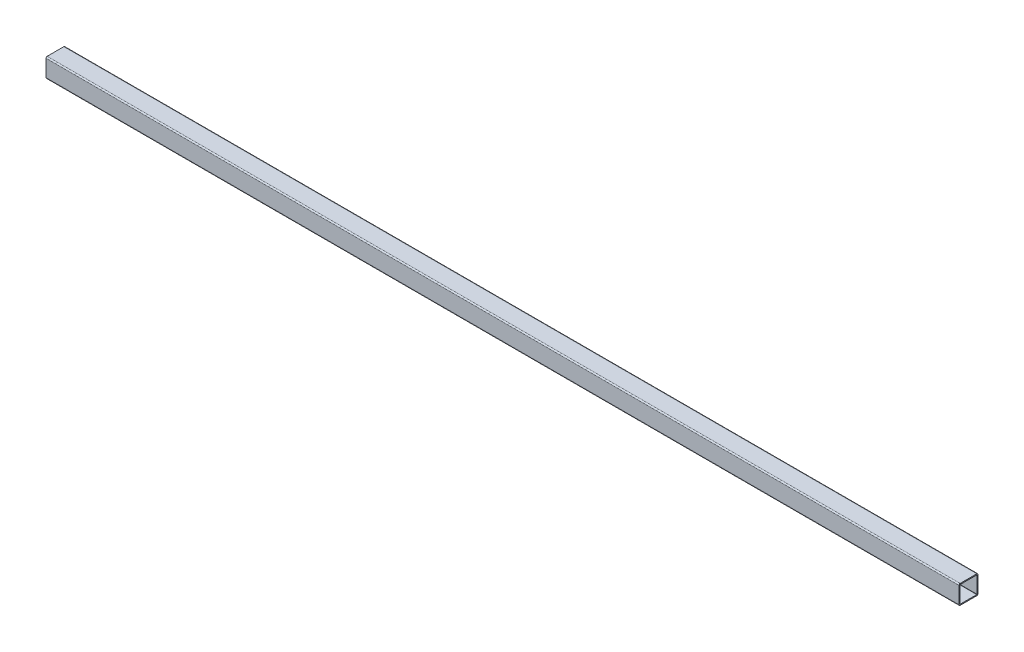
ISO-10303-21;
HEADER;
FILE_DESCRIPTION(('STEP AP214'),'2;1');
FILE_NAME('part.step','',(''),(''),'','','');
FILE_SCHEMA(('AUTOMOTIVE_DESIGN { 1 0 10303 214 1 1 1 1 }'));
ENDSEC;
DATA;
#1=APPLICATION_CONTEXT('core data for automotive mechanical design processes');
#2=APPLICATION_PROTOCOL_DEFINITION('international standard','automotive_design',2000,#1);
#3=PRODUCT_CONTEXT('',#1,'mechanical');
#4=PRODUCT('Part','Part','',(#3));
#5=PRODUCT_RELATED_PRODUCT_CATEGORY('part','',(#4));
#6=PRODUCT_DEFINITION_FORMATION('','',#4);
#7=PRODUCT_DEFINITION_CONTEXT('part definition',#1,'design');
#8=PRODUCT_DEFINITION('design','',#6,#7);
#9=PRODUCT_DEFINITION_SHAPE('','',#8);
#10=(LENGTH_UNIT() NAMED_UNIT(*) SI_UNIT(.MILLI.,.METRE.));
#11=(NAMED_UNIT(*) PLANE_ANGLE_UNIT() SI_UNIT($,.RADIAN.));
#12=(NAMED_UNIT(*) SI_UNIT($,.STERADIAN.) SOLID_ANGLE_UNIT());
#13=UNCERTAINTY_MEASURE_WITH_UNIT(LENGTH_MEASURE(1.E-05),#10,'distance_accuracy_value','');
#14=(GEOMETRIC_REPRESENTATION_CONTEXT(3) GLOBAL_UNCERTAINTY_ASSIGNED_CONTEXT((#13)) GLOBAL_UNIT_ASSIGNED_CONTEXT((#10,
#11,#12)) REPRESENTATION_CONTEXT('',''));
#15=CARTESIAN_POINT('',(0.,0.,0.));
#16=DIRECTION('',(0.,0.,1.));
#17=DIRECTION('',(1.,0.,0.));
#18=AXIS2_PLACEMENT_3D('',#15,#16,#17);
#19=CARTESIAN_POINT('',(1219.2,3.65674086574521,-16.8519621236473));
#20=DIRECTION('',(-1.,0.,0.));
#21=DIRECTION('',(0.,0.,1.));
#22=AXIS2_PLACEMENT_3D('',#19,#20,#21);
#23=PLANE('',#22);
#24=CARTESIAN_POINT('',(1219.2,3.65674086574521,-16.8519621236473));
#25=DIRECTION('',(1.,0.,0.));
#26=DIRECTION('',(0.,0.,1.));
#27=AXIS2_PLACEMENT_3D('',#24,#25,#26);
#28=CIRCLE('',#27,1.5875);
#29=CARTESIAN_POINT('',(1219.2,3.6567408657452,-18.4394621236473));
#30=VERTEX_POINT('',#29);
#31=CARTESIAN_POINT('',(1219.2,5.24424086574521,-16.8519621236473));
#32=VERTEX_POINT('',#31);
#33=EDGE_CURVE('E211',#30,#32,#28,.T.);
#34=ORIENTED_EDGE('',*,*,#33,.T.);
#35=DIRECTION('',(0.,0.,1.));
#36=VECTOR('',#35,1.);
#37=CARTESIAN_POINT('',(1219.2,5.24424086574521,5.37303787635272));
#38=LINE('',#37,#36);
#39=CARTESIAN_POINT('',(1219.2,5.24424086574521,5.37303787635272));
#40=VERTEX_POINT('',#39);
#41=EDGE_CURVE('E214',#32,#40,#38,.T.);
#42=ORIENTED_EDGE('',*,*,#41,.T.);
#43=CARTESIAN_POINT('',(1219.2,3.65674086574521,5.37303787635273));
#44=DIRECTION('',(1.,0.,0.));
#45=DIRECTION('',(0.,0.,1.));
#46=AXIS2_PLACEMENT_3D('',#43,#44,#45);
#47=CIRCLE('',#46,1.5875);
#48=CARTESIAN_POINT('',(1219.2,3.6567408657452,6.96053787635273));
#49=VERTEX_POINT('',#48);
#50=EDGE_CURVE('E217',#40,#49,#47,.T.);
#51=ORIENTED_EDGE('',*,*,#50,.T.);
#52=DIRECTION('',(0.,-1.,0.));
#53=VECTOR('',#52,1.);
#54=CARTESIAN_POINT('',(1219.2,3.6567408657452,6.96053787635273));
#55=LINE('',#54,#53);
#56=CARTESIAN_POINT('',(1219.2,-18.5682591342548,6.96053787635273));
#57=VERTEX_POINT('',#56);
#58=EDGE_CURVE('E219',#49,#57,#55,.T.);
#59=ORIENTED_EDGE('',*,*,#58,.T.);
#60=CARTESIAN_POINT('',(1219.2,-18.5682591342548,5.37303787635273));
#61=DIRECTION('',(1.,0.,0.));
#62=DIRECTION('',(0.,0.,1.));
#63=AXIS2_PLACEMENT_3D('',#60,#61,#62);
#64=CIRCLE('',#63,1.5875);
#65=CARTESIAN_POINT('',(1219.2,-20.1557591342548,5.37303787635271));
#66=VERTEX_POINT('',#65);
#67=EDGE_CURVE('E221',#57,#66,#64,.T.);
#68=ORIENTED_EDGE('',*,*,#67,.T.);
#69=DIRECTION('',(0.,0.,-1.));
#70=VECTOR('',#69,1.);
#71=CARTESIAN_POINT('',(1219.2,-20.1557591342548,5.37303787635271));
#72=LINE('',#71,#70);
#73=CARTESIAN_POINT('',(1219.2,-20.1557591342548,-16.8519621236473));
#74=VERTEX_POINT('',#73);
#75=EDGE_CURVE('E223',#66,#74,#72,.T.);
#76=ORIENTED_EDGE('',*,*,#75,.T.);
#77=CARTESIAN_POINT('',(1219.2,-18.5682591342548,-16.8519621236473));
#78=DIRECTION('',(1.,0.,0.));
#79=DIRECTION('',(0.,0.,1.));
#80=AXIS2_PLACEMENT_3D('',#77,#78,#79);
#81=CIRCLE('',#80,1.5875);
#82=CARTESIAN_POINT('',(1219.2,-18.5682591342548,-18.4394621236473));
#83=VERTEX_POINT('',#82);
#84=EDGE_CURVE('E225',#74,#83,#81,.T.);
#85=ORIENTED_EDGE('',*,*,#84,.T.);
#86=DIRECTION('',(0.,1.,0.));
#87=VECTOR('',#86,1.);
#88=CARTESIAN_POINT('',(1219.2,3.6567408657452,-18.4394621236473));
#89=LINE('',#88,#87);
#90=EDGE_CURVE('E227',#83,#30,#89,.T.);
#91=ORIENTED_EDGE('',*,*,#90,.T.);
#92=EDGE_LOOP('',(#34,#42,#51,#59,#68,#76,#85,#91));
#93=FACE_BOUND('',#92,.T.);
#94=CARTESIAN_POINT('',(1219.2,3.65674086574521,5.37303787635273));
#95=DIRECTION('',(1.,0.,0.));
#96=DIRECTION('',(0.,0.,1.));
#97=AXIS2_PLACEMENT_3D('',#94,#95,#96);
#98=CIRCLE('',#97,0.2413);
#99=CARTESIAN_POINT('',(1219.2,3.89804086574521,5.37303787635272));
#100=VERTEX_POINT('',#99);
#101=CARTESIAN_POINT('',(1219.2,3.6567408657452,5.61433787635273));
#102=VERTEX_POINT('',#101);
#103=EDGE_CURVE('E146',#100,#102,#98,.T.);
#104=ORIENTED_EDGE('',*,*,#103,.F.);
#105=DIRECTION('',(0.,0.,1.));
#106=VECTOR('',#105,1.);
#107=CARTESIAN_POINT('',(1219.2,3.89804086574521,5.37303787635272));
#108=LINE('',#107,#106);
#109=CARTESIAN_POINT('',(1219.2,3.89804086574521,-16.8519621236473));
#110=VERTEX_POINT('',#109);
#111=EDGE_CURVE('E179',#110,#100,#108,.T.);
#112=ORIENTED_EDGE('',*,*,#111,.F.);
#113=CARTESIAN_POINT('',(1219.2,3.65674086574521,-16.8519621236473));
#114=DIRECTION('',(1.,0.,0.));
#115=DIRECTION('',(0.,0.,1.));
#116=AXIS2_PLACEMENT_3D('',#113,#114,#115);
#117=CIRCLE('',#116,0.2413);
#118=CARTESIAN_POINT('',(1219.2,3.65674086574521,-17.0932621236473));
#119=VERTEX_POINT('',#118);
#120=EDGE_CURVE('E177',#119,#110,#117,.T.);
#121=ORIENTED_EDGE('',*,*,#120,.F.);
#122=DIRECTION('',(0.,1.,0.));
#123=VECTOR('',#122,1.);
#124=CARTESIAN_POINT('',(1219.2,3.65674086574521,-17.0932621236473));
#125=LINE('',#124,#123);
#126=CARTESIAN_POINT('',(1219.2,-18.5682591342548,-17.0932621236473));
#127=VERTEX_POINT('',#126);
#128=EDGE_CURVE('E175',#127,#119,#125,.T.);
#129=ORIENTED_EDGE('',*,*,#128,.F.);
#130=CARTESIAN_POINT('',(1219.2,-18.5682591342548,-16.8519621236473));
#131=DIRECTION('',(1.,0.,0.));
#132=DIRECTION('',(0.,0.,1.));
#133=AXIS2_PLACEMENT_3D('',#130,#131,#132);
#134=CIRCLE('',#133,0.241299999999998);
#135=CARTESIAN_POINT('',(1219.2,-18.8095591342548,-16.8519621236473));
#136=VERTEX_POINT('',#135);
#137=EDGE_CURVE('E173',#136,#127,#134,.T.);
#138=ORIENTED_EDGE('',*,*,#137,.F.);
#139=DIRECTION('',(0.,0.,-1.));
#140=VECTOR('',#139,1.);
#141=CARTESIAN_POINT('',(1219.2,-18.8095591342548,5.37303787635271));
#142=LINE('',#141,#140);
#143=CARTESIAN_POINT('',(1219.2,-18.8095591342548,5.37303787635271));
#144=VERTEX_POINT('',#143);
#145=EDGE_CURVE('E169',#144,#136,#142,.T.);
#146=ORIENTED_EDGE('',*,*,#145,.F.);
#147=CARTESIAN_POINT('',(1219.2,-18.5682591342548,5.37303787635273));
#148=DIRECTION('',(1.,0.,0.));
#149=DIRECTION('',(0.,0.,1.));
#150=AXIS2_PLACEMENT_3D('',#147,#148,#149);
#151=CIRCLE('',#150,0.241299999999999);
#152=CARTESIAN_POINT('',(1219.2,-18.5682591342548,5.61433787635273));
#153=VERTEX_POINT('',#152);
#154=EDGE_CURVE('E167',#153,#144,#151,.T.);
#155=ORIENTED_EDGE('',*,*,#154,.F.);
#156=DIRECTION('',(0.,-1.,0.));
#157=VECTOR('',#156,1.);
#158=CARTESIAN_POINT('',(1219.2,3.6567408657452,5.61433787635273));
#159=LINE('',#158,#157);
#160=EDGE_CURVE('E154',#102,#153,#159,.T.);
#161=ORIENTED_EDGE('',*,*,#160,.F.);
#162=EDGE_LOOP('',(#104,#112,#121,#129,#138,#146,#155,#161));
#163=FACE_BOUND('',#162,.T.);
#164=ADVANCED_FACE('F33',(#93,#163),#23,.F.);
#165=CARTESIAN_POINT('',(0.,3.65674086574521,-16.8519621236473));
#166=DIRECTION('',(-1.,0.,0.));
#167=DIRECTION('',(0.,0.,1.));
#168=AXIS2_PLACEMENT_3D('',#165,#166,#167);
#169=PLANE('',#168);
#170=CARTESIAN_POINT('',(0.,3.65674086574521,-16.8519621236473));
#171=DIRECTION('',(1.,0.,0.));
#172=DIRECTION('',(0.,0.,1.));
#173=AXIS2_PLACEMENT_3D('',#170,#171,#172);
#174=CIRCLE('',#173,1.5875);
#175=CARTESIAN_POINT('',(0.,3.6567408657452,-18.4394621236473));
#176=VERTEX_POINT('',#175);
#177=CARTESIAN_POINT('',(0.,5.24424086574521,-16.8519621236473));
#178=VERTEX_POINT('',#177);
#179=EDGE_CURVE('E162',#176,#178,#174,.T.);
#180=ORIENTED_EDGE('',*,*,#179,.F.);
#181=DIRECTION('',(0.,1.,0.));
#182=VECTOR('',#181,1.);
#183=CARTESIAN_POINT('',(0.,3.6567408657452,-18.4394621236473));
#184=LINE('',#183,#182);
#185=CARTESIAN_POINT('',(0.,-18.5682591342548,-18.4394621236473));
#186=VERTEX_POINT('',#185);
#187=EDGE_CURVE('E215',#186,#176,#184,.T.);
#188=ORIENTED_EDGE('',*,*,#187,.F.);
#189=CARTESIAN_POINT('',(0.,-18.5682591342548,-16.8519621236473));
#190=DIRECTION('',(1.,0.,0.));
#191=DIRECTION('',(0.,0.,1.));
#192=AXIS2_PLACEMENT_3D('',#189,#190,#191);
#193=CIRCLE('',#192,1.5875);
#194=CARTESIAN_POINT('',(0.,-20.1557591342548,-16.8519621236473));
#195=VERTEX_POINT('',#194);
#196=EDGE_CURVE('E242',#195,#186,#193,.T.);
#197=ORIENTED_EDGE('',*,*,#196,.F.);
#198=DIRECTION('',(0.,0.,-1.));
#199=VECTOR('',#198,1.);
#200=CARTESIAN_POINT('',(0.,-20.1557591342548,5.37303787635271));
#201=LINE('',#200,#199);
#202=CARTESIAN_POINT('',(0.,-20.1557591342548,5.37303787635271));
#203=VERTEX_POINT('',#202);
#204=EDGE_CURVE('E240',#203,#195,#201,.T.);
#205=ORIENTED_EDGE('',*,*,#204,.F.);
#206=CARTESIAN_POINT('',(0.,-18.5682591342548,5.37303787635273));
#207=DIRECTION('',(1.,0.,0.));
#208=DIRECTION('',(0.,0.,1.));
#209=AXIS2_PLACEMENT_3D('',#206,#207,#208);
#210=CIRCLE('',#209,1.5875);
#211=CARTESIAN_POINT('',(0.,-18.5682591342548,6.96053787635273));
#212=VERTEX_POINT('',#211);
#213=EDGE_CURVE('E238',#212,#203,#210,.T.);
#214=ORIENTED_EDGE('',*,*,#213,.F.);
#215=DIRECTION('',(0.,-1.,0.));
#216=VECTOR('',#215,1.);
#217=CARTESIAN_POINT('',(0.,3.6567408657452,6.96053787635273));
#218=LINE('',#217,#216);
#219=CARTESIAN_POINT('',(0.,3.6567408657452,6.96053787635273));
#220=VERTEX_POINT('',#219);
#221=EDGE_CURVE('E236',#220,#212,#218,.T.);
#222=ORIENTED_EDGE('',*,*,#221,.F.);
#223=CARTESIAN_POINT('',(0.,3.65674086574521,5.37303787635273));
#224=DIRECTION('',(1.,0.,0.));
#225=DIRECTION('',(0.,0.,1.));
#226=AXIS2_PLACEMENT_3D('',#223,#224,#225);
#227=CIRCLE('',#226,1.5875);
#228=CARTESIAN_POINT('',(0.,5.24424086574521,5.37303787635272));
#229=VERTEX_POINT('',#228);
#230=EDGE_CURVE('E234',#229,#220,#227,.T.);
#231=ORIENTED_EDGE('',*,*,#230,.F.);
#232=DIRECTION('',(0.,0.,1.));
#233=VECTOR('',#232,1.);
#234=CARTESIAN_POINT('',(0.,5.24424086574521,5.37303787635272));
#235=LINE('',#234,#233);
#236=EDGE_CURVE('E232',#178,#229,#235,.T.);
#237=ORIENTED_EDGE('',*,*,#236,.F.);
#238=EDGE_LOOP('',(#180,#188,#197,#205,#214,#222,#231,#237));
#239=FACE_BOUND('',#238,.T.);
#240=DIRECTION('',(0.,0.,1.));
#241=VECTOR('',#240,1.);
#242=CARTESIAN_POINT('',(0.,3.89804086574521,5.37303787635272));
#243=LINE('',#242,#241);
#244=CARTESIAN_POINT('',(0.,3.89804086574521,-16.8519621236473));
#245=VERTEX_POINT('',#244);
#246=CARTESIAN_POINT('',(0.,3.89804086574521,5.37303787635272));
#247=VERTEX_POINT('',#246);
#248=EDGE_CURVE('E155',#245,#247,#243,.T.);
#249=ORIENTED_EDGE('',*,*,#248,.T.);
#250=CARTESIAN_POINT('',(0.,3.65674086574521,5.37303787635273));
#251=DIRECTION('',(1.,0.,0.));
#252=DIRECTION('',(0.,0.,1.));
#253=AXIS2_PLACEMENT_3D('',#250,#251,#252);
#254=CIRCLE('',#253,0.2413);
#255=CARTESIAN_POINT('',(0.,3.6567408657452,5.61433787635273));
#256=VERTEX_POINT('',#255);
#257=EDGE_CURVE('E56',#247,#256,#254,.T.);
#258=ORIENTED_EDGE('',*,*,#257,.T.);
#259=DIRECTION('',(0.,-1.,0.));
#260=VECTOR('',#259,1.);
#261=CARTESIAN_POINT('',(0.,3.6567408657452,5.61433787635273));
#262=LINE('',#261,#260);
#263=CARTESIAN_POINT('',(0.,-18.5682591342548,5.61433787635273));
#264=VERTEX_POINT('',#263);
#265=EDGE_CURVE('E161',#256,#264,#262,.T.);
#266=ORIENTED_EDGE('',*,*,#265,.T.);
#267=CARTESIAN_POINT('',(0.,-18.5682591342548,5.37303787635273));
#268=DIRECTION('',(1.,0.,0.));
#269=DIRECTION('',(0.,0.,1.));
#270=AXIS2_PLACEMENT_3D('',#267,#268,#269);
#271=CIRCLE('',#270,0.241299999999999);
#272=CARTESIAN_POINT('',(0.,-18.8095591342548,5.37303787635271));
#273=VERTEX_POINT('',#272);
#274=EDGE_CURVE('E183',#264,#273,#271,.T.);
#275=ORIENTED_EDGE('',*,*,#274,.T.);
#276=DIRECTION('',(0.,0.,-1.));
#277=VECTOR('',#276,1.);
#278=CARTESIAN_POINT('',(0.,-18.8095591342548,5.37303787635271));
#279=LINE('',#278,#277);
#280=CARTESIAN_POINT('',(0.,-18.8095591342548,-16.8519621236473));
#281=VERTEX_POINT('',#280);
#282=EDGE_CURVE('E186',#273,#281,#279,.T.);
#283=ORIENTED_EDGE('',*,*,#282,.T.);
#284=CARTESIAN_POINT('',(0.,-18.5682591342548,-16.8519621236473));
#285=DIRECTION('',(1.,0.,0.));
#286=DIRECTION('',(0.,0.,1.));
#287=AXIS2_PLACEMENT_3D('',#284,#285,#286);
#288=CIRCLE('',#287,0.241299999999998);
#289=CARTESIAN_POINT('',(0.,-18.5682591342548,-17.0932621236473));
#290=VERTEX_POINT('',#289);
#291=EDGE_CURVE('E189',#281,#290,#288,.T.);
#292=ORIENTED_EDGE('',*,*,#291,.T.);
#293=DIRECTION('',(0.,1.,0.));
#294=VECTOR('',#293,1.);
#295=CARTESIAN_POINT('',(0.,3.65674086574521,-17.0932621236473));
#296=LINE('',#295,#294);
#297=CARTESIAN_POINT('',(0.,3.65674086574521,-17.0932621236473));
#298=VERTEX_POINT('',#297);
#299=EDGE_CURVE('E192',#290,#298,#296,.T.);
#300=ORIENTED_EDGE('',*,*,#299,.T.);
#301=CARTESIAN_POINT('',(0.,3.65674086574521,-16.8519621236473));
#302=DIRECTION('',(1.,0.,0.));
#303=DIRECTION('',(0.,0.,1.));
#304=AXIS2_PLACEMENT_3D('',#301,#302,#303);
#305=CIRCLE('',#304,0.2413);
#306=EDGE_CURVE('E195',#298,#245,#305,.T.);
#307=ORIENTED_EDGE('',*,*,#306,.T.);
#308=EDGE_LOOP('',(#249,#258,#266,#275,#283,#292,#300,#307));
#309=FACE_BOUND('',#308,.T.);
#310=ADVANCED_FACE('F272',(#239,#309),#169,.T.);
#311=CARTESIAN_POINT('',(1219.2,3.65674086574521,-16.8519621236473));
#312=DIRECTION('',(-1.,0.,0.));
#313=DIRECTION('',(0.,0.,1.));
#314=AXIS2_PLACEMENT_3D('',#311,#312,#313);
#315=CYLINDRICAL_SURFACE('',#314,1.5875);
#316=ORIENTED_EDGE('',*,*,#179,.T.);
#317=DIRECTION('',(-1.,0.,0.));
#318=VECTOR('',#317,1.);
#319=CARTESIAN_POINT('',(1219.2,5.24424086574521,-16.8519621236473));
#320=LINE('',#319,#318);
#321=EDGE_CURVE('E11',#32,#178,#320,.T.);
#322=ORIENTED_EDGE('',*,*,#321,.F.);
#323=ORIENTED_EDGE('',*,*,#33,.F.);
#324=DIRECTION('',(-1.,0.,0.));
#325=VECTOR('',#324,1.);
#326=CARTESIAN_POINT('',(1219.2,3.6567408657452,-18.4394621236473));
#327=LINE('',#326,#325);
#328=EDGE_CURVE('E229',#30,#176,#327,.T.);
#329=ORIENTED_EDGE('',*,*,#328,.T.);
#330=EDGE_LOOP('',(#316,#322,#323,#329));
#331=FACE_BOUND('',#330,.T.);
#332=ADVANCED_FACE('F35',(#331),#315,.T.);
#333=CARTESIAN_POINT('',(1219.2,5.24424086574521,5.37303787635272));
#334=DIRECTION('',(0.,-1.,0.));
#335=DIRECTION('',(0.,0.,-1.));
#336=AXIS2_PLACEMENT_3D('',#333,#334,#335);
#337=PLANE('',#336);
#338=ORIENTED_EDGE('',*,*,#236,.T.);
#339=DIRECTION('',(-1.,0.,0.));
#340=VECTOR('',#339,1.);
#341=CARTESIAN_POINT('',(1219.2,5.24424086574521,5.37303787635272));
#342=LINE('',#341,#340);
#343=EDGE_CURVE('E41',#40,#229,#342,.T.);
#344=ORIENTED_EDGE('',*,*,#343,.F.);
#345=ORIENTED_EDGE('',*,*,#41,.F.);
#346=ORIENTED_EDGE('',*,*,#321,.T.);
#347=EDGE_LOOP('',(#338,#344,#345,#346));
#348=FACE_BOUND('',#347,.T.);
#349=ADVANCED_FACE('F289',(#348),#337,.F.);
#350=CARTESIAN_POINT('',(1219.2,3.65674086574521,5.37303787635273));
#351=DIRECTION('',(-1.,0.,0.));
#352=DIRECTION('',(0.,0.,1.));
#353=AXIS2_PLACEMENT_3D('',#350,#351,#352);
#354=CYLINDRICAL_SURFACE('',#353,1.5875);
#355=ORIENTED_EDGE('',*,*,#230,.T.);
#356=DIRECTION('',(-1.,0.,0.));
#357=VECTOR('',#356,1.);
#358=CARTESIAN_POINT('',(1219.2,3.6567408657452,6.96053787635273));
#359=LINE('',#358,#357);
#360=EDGE_CURVE('E259',#49,#220,#359,.T.);
#361=ORIENTED_EDGE('',*,*,#360,.F.);
#362=ORIENTED_EDGE('',*,*,#50,.F.);
#363=ORIENTED_EDGE('',*,*,#343,.T.);
#364=EDGE_LOOP('',(#355,#361,#362,#363));
#365=FACE_BOUND('',#364,.T.);
#366=ADVANCED_FACE('F266',(#365),#354,.T.);
#367=CARTESIAN_POINT('',(1219.2,3.6567408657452,6.96053787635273));
#368=DIRECTION('',(0.,0.,-1.));
#369=DIRECTION('',(0.,1.,0.));
#370=AXIS2_PLACEMENT_3D('',#367,#368,#369);
#371=PLANE('',#370);
#372=ORIENTED_EDGE('',*,*,#221,.T.);
#373=DIRECTION('',(-1.,0.,0.));
#374=VECTOR('',#373,1.);
#375=CARTESIAN_POINT('',(1219.2,-18.5682591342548,6.96053787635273));
#376=LINE('',#375,#374);
#377=EDGE_CURVE('E256',#57,#212,#376,.T.);
#378=ORIENTED_EDGE('',*,*,#377,.F.);
#379=ORIENTED_EDGE('',*,*,#58,.F.);
#380=ORIENTED_EDGE('',*,*,#360,.T.);
#381=EDGE_LOOP('',(#372,#378,#379,#380));
#382=FACE_BOUND('',#381,.T.);
#383=ADVANCED_FACE('F278',(#382),#371,.F.);
#384=CARTESIAN_POINT('',(1219.2,-18.5682591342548,5.37303787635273));
#385=DIRECTION('',(-1.,0.,0.));
#386=DIRECTION('',(0.,0.,1.));
#387=AXIS2_PLACEMENT_3D('',#384,#385,#386);
#388=CYLINDRICAL_SURFACE('',#387,1.5875);
#389=ORIENTED_EDGE('',*,*,#213,.T.);
#390=DIRECTION('',(-1.,0.,0.));
#391=VECTOR('',#390,1.);
#392=CARTESIAN_POINT('',(1219.2,-20.1557591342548,5.37303787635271));
#393=LINE('',#392,#391);
#394=EDGE_CURVE('E253',#66,#203,#393,.T.);
#395=ORIENTED_EDGE('',*,*,#394,.F.);
#396=ORIENTED_EDGE('',*,*,#67,.F.);
#397=ORIENTED_EDGE('',*,*,#377,.T.);
#398=EDGE_LOOP('',(#389,#395,#396,#397));
#399=FACE_BOUND('',#398,.T.);
#400=ADVANCED_FACE('F282',(#399),#388,.T.);
#401=CARTESIAN_POINT('',(1219.2,-20.1557591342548,5.37303787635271));
#402=DIRECTION('',(0.,1.,0.));
#403=DIRECTION('',(0.,0.,1.));
#404=AXIS2_PLACEMENT_3D('',#401,#402,#403);
#405=PLANE('',#404);
#406=ORIENTED_EDGE('',*,*,#204,.T.);
#407=DIRECTION('',(-1.,0.,0.));
#408=VECTOR('',#407,1.);
#409=CARTESIAN_POINT('',(1219.2,-20.1557591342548,-16.8519621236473));
#410=LINE('',#409,#408);
#411=EDGE_CURVE('E250',#74,#195,#410,.T.);
#412=ORIENTED_EDGE('',*,*,#411,.F.);
#413=ORIENTED_EDGE('',*,*,#75,.F.);
#414=ORIENTED_EDGE('',*,*,#394,.T.);
#415=EDGE_LOOP('',(#406,#412,#413,#414));
#416=FACE_BOUND('',#415,.T.);
#417=ADVANCED_FACE('F302',(#416),#405,.F.);
#418=CARTESIAN_POINT('',(1219.2,-18.5682591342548,-16.8519621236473));
#419=DIRECTION('',(-1.,0.,0.));
#420=DIRECTION('',(0.,0.,1.));
#421=AXIS2_PLACEMENT_3D('',#418,#419,#420);
#422=CYLINDRICAL_SURFACE('',#421,1.5875);
#423=ORIENTED_EDGE('',*,*,#196,.T.);
#424=DIRECTION('',(-1.,0.,0.));
#425=VECTOR('',#424,1.);
#426=CARTESIAN_POINT('',(1219.2,-18.5682591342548,-18.4394621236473));
#427=LINE('',#426,#425);
#428=EDGE_CURVE('E247',#83,#186,#427,.T.);
#429=ORIENTED_EDGE('',*,*,#428,.F.);
#430=ORIENTED_EDGE('',*,*,#84,.F.);
#431=ORIENTED_EDGE('',*,*,#411,.T.);
#432=EDGE_LOOP('',(#423,#429,#430,#431));
#433=FACE_BOUND('',#432,.T.);
#434=ADVANCED_FACE('F300',(#433),#422,.T.);
#435=CARTESIAN_POINT('',(1219.2,3.6567408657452,-18.4394621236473));
#436=DIRECTION('',(0.,0.,1.));
#437=DIRECTION('',(0.,-1.,0.));
#438=AXIS2_PLACEMENT_3D('',#435,#436,#437);
#439=PLANE('',#438);
#440=ORIENTED_EDGE('',*,*,#187,.T.);
#441=ORIENTED_EDGE('',*,*,#328,.F.);
#442=ORIENTED_EDGE('',*,*,#90,.F.);
#443=ORIENTED_EDGE('',*,*,#428,.T.);
#444=EDGE_LOOP('',(#440,#441,#442,#443));
#445=FACE_BOUND('',#444,.T.);
#446=ADVANCED_FACE('F295',(#445),#439,.F.);
#447=CARTESIAN_POINT('',(1219.2,3.65674086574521,5.37303787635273));
#448=DIRECTION('',(-1.,0.,0.));
#449=DIRECTION('',(0.,0.,1.));
#450=AXIS2_PLACEMENT_3D('',#447,#448,#449);
#451=CYLINDRICAL_SURFACE('',#450,0.2413);
#452=ORIENTED_EDGE('',*,*,#257,.F.);
#453=DIRECTION('',(-1.,0.,0.));
#454=VECTOR('',#453,1.);
#455=CARTESIAN_POINT('',(1219.2,3.89804086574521,5.37303787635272));
#456=LINE('',#455,#454);
#457=EDGE_CURVE('E150',#100,#247,#456,.T.);
#458=ORIENTED_EDGE('',*,*,#457,.F.);
#459=ORIENTED_EDGE('',*,*,#103,.T.);
#460=DIRECTION('',(-1.,0.,0.));
#461=VECTOR('',#460,1.);
#462=CARTESIAN_POINT('',(1219.2,3.6567408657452,5.61433787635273));
#463=LINE('',#462,#461);
#464=EDGE_CURVE('E149',#102,#256,#463,.T.);
#465=ORIENTED_EDGE('',*,*,#464,.T.);
#466=EDGE_LOOP('',(#452,#458,#459,#465));
#467=FACE_BOUND('',#466,.T.);
#468=ADVANCED_FACE('F148',(#467),#451,.F.);
#469=CARTESIAN_POINT('',(1219.2,3.6567408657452,5.61433787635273));
#470=DIRECTION('',(0.,0.,-1.));
#471=DIRECTION('',(0.,1.,0.));
#472=AXIS2_PLACEMENT_3D('',#469,#470,#471);
#473=PLANE('',#472);
#474=ORIENTED_EDGE('',*,*,#265,.F.);
#475=ORIENTED_EDGE('',*,*,#464,.F.);
#476=ORIENTED_EDGE('',*,*,#160,.T.);
#477=DIRECTION('',(-1.,0.,0.));
#478=VECTOR('',#477,1.);
#479=CARTESIAN_POINT('',(1219.2,-18.5682591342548,5.61433787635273));
#480=LINE('',#479,#478);
#481=EDGE_CURVE('E163',#153,#264,#480,.T.);
#482=ORIENTED_EDGE('',*,*,#481,.T.);
#483=EDGE_LOOP('',(#474,#475,#476,#482));
#484=FACE_BOUND('',#483,.T.);
#485=ADVANCED_FACE('F158',(#484),#473,.T.);
#486=CARTESIAN_POINT('',(1219.2,-18.5682591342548,5.37303787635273));
#487=DIRECTION('',(-1.,0.,0.));
#488=DIRECTION('',(0.,0.,1.));
#489=AXIS2_PLACEMENT_3D('',#486,#487,#488);
#490=CYLINDRICAL_SURFACE('',#489,0.241299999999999);
#491=ORIENTED_EDGE('',*,*,#274,.F.);
#492=ORIENTED_EDGE('',*,*,#481,.F.);
#493=ORIENTED_EDGE('',*,*,#154,.T.);
#494=DIRECTION('',(-1.,0.,0.));
#495=VECTOR('',#494,1.);
#496=CARTESIAN_POINT('',(1219.2,-18.8095591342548,5.37303787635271));
#497=LINE('',#496,#495);
#498=EDGE_CURVE('E208',#144,#273,#497,.T.);
#499=ORIENTED_EDGE('',*,*,#498,.T.);
#500=EDGE_LOOP('',(#491,#492,#493,#499));
#501=FACE_BOUND('',#500,.T.);
#502=ADVANCED_FACE('F327',(#501),#490,.F.);
#503=CARTESIAN_POINT('',(1219.2,-18.8095591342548,5.37303787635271));
#504=DIRECTION('',(0.,1.,0.));
#505=DIRECTION('',(0.,0.,1.));
#506=AXIS2_PLACEMENT_3D('',#503,#504,#505);
#507=PLANE('',#506);
#508=ORIENTED_EDGE('',*,*,#282,.F.);
#509=ORIENTED_EDGE('',*,*,#498,.F.);
#510=ORIENTED_EDGE('',*,*,#145,.T.);
#511=DIRECTION('',(-1.,0.,0.));
#512=VECTOR('',#511,1.);
#513=CARTESIAN_POINT('',(1219.2,-18.8095591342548,-16.8519621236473));
#514=LINE('',#513,#512);
#515=EDGE_CURVE('E206',#136,#281,#514,.T.);
#516=ORIENTED_EDGE('',*,*,#515,.T.);
#517=EDGE_LOOP('',(#508,#509,#510,#516));
#518=FACE_BOUND('',#517,.T.);
#519=ADVANCED_FACE('F331',(#518),#507,.T.);
#520=CARTESIAN_POINT('',(1219.2,-18.5682591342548,-16.8519621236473));
#521=DIRECTION('',(-1.,0.,0.));
#522=DIRECTION('',(0.,0.,1.));
#523=AXIS2_PLACEMENT_3D('',#520,#521,#522);
#524=CYLINDRICAL_SURFACE('',#523,0.241299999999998);
#525=ORIENTED_EDGE('',*,*,#291,.F.);
#526=ORIENTED_EDGE('',*,*,#515,.F.);
#527=ORIENTED_EDGE('',*,*,#137,.T.);
#528=DIRECTION('',(-1.,0.,0.));
#529=VECTOR('',#528,1.);
#530=CARTESIAN_POINT('',(1219.2,-18.5682591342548,-17.0932621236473));
#531=LINE('',#530,#529);
#532=EDGE_CURVE('E204',#127,#290,#531,.T.);
#533=ORIENTED_EDGE('',*,*,#532,.T.);
#534=EDGE_LOOP('',(#525,#526,#527,#533));
#535=FACE_BOUND('',#534,.T.);
#536=ADVANCED_FACE('F337',(#535),#524,.F.);
#537=CARTESIAN_POINT('',(1219.2,3.65674086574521,-17.0932621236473));
#538=DIRECTION('',(0.,0.,1.));
#539=DIRECTION('',(1.,0.,0.));
#540=AXIS2_PLACEMENT_3D('',#537,#538,#539);
#541=PLANE('',#540);
#542=ORIENTED_EDGE('',*,*,#299,.F.);
#543=ORIENTED_EDGE('',*,*,#532,.F.);
#544=ORIENTED_EDGE('',*,*,#128,.T.);
#545=DIRECTION('',(-1.,0.,0.));
#546=VECTOR('',#545,1.);
#547=CARTESIAN_POINT('',(1219.2,3.65674086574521,-17.0932621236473));
#548=LINE('',#547,#546);
#549=EDGE_CURVE('E202',#119,#298,#548,.T.);
#550=ORIENTED_EDGE('',*,*,#549,.T.);
#551=EDGE_LOOP('',(#542,#543,#544,#550));
#552=FACE_BOUND('',#551,.T.);
#553=ADVANCED_FACE('F341',(#552),#541,.T.);
#554=CARTESIAN_POINT('',(1219.2,3.65674086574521,-16.8519621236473));
#555=DIRECTION('',(-1.,0.,0.));
#556=DIRECTION('',(0.,0.,1.));
#557=AXIS2_PLACEMENT_3D('',#554,#555,#556);
#558=CYLINDRICAL_SURFACE('',#557,0.2413);
#559=ORIENTED_EDGE('',*,*,#306,.F.);
#560=ORIENTED_EDGE('',*,*,#549,.F.);
#561=ORIENTED_EDGE('',*,*,#120,.T.);
#562=DIRECTION('',(-1.,0.,0.));
#563=VECTOR('',#562,1.);
#564=CARTESIAN_POINT('',(1219.2,3.89804086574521,-16.8519621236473));
#565=LINE('',#564,#563);
#566=EDGE_CURVE('E48',#110,#245,#565,.T.);
#567=ORIENTED_EDGE('',*,*,#566,.T.);
#568=EDGE_LOOP('',(#559,#560,#561,#567));
#569=FACE_BOUND('',#568,.T.);
#570=ADVANCED_FACE('F345',(#569),#558,.F.);
#571=CARTESIAN_POINT('',(1219.2,3.89804086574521,5.37303787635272));
#572=DIRECTION('',(0.,-1.,0.));
#573=DIRECTION('',(0.,0.,-1.));
#574=AXIS2_PLACEMENT_3D('',#571,#572,#573);
#575=PLANE('',#574);
#576=ORIENTED_EDGE('',*,*,#248,.F.);
#577=ORIENTED_EDGE('',*,*,#566,.F.);
#578=ORIENTED_EDGE('',*,*,#111,.T.);
#579=ORIENTED_EDGE('',*,*,#457,.T.);
#580=EDGE_LOOP('',(#576,#577,#578,#579));
#581=FACE_BOUND('',#580,.T.);
#582=ADVANCED_FACE('F349',(#581),#575,.T.);
#583=CLOSED_SHELL('',(#164,#310,#332,#349,#366,#383,#400,#417,#434,#446,#468,#485,#502,#519,
#536,#553,#570,#582));
#584=MANIFOLD_SOLID_BREP('B2',#583);
#585=ADVANCED_BREP_SHAPE_REPRESENTATION('',(#18,#584),#14);
#586=SHAPE_DEFINITION_REPRESENTATION(#9,#585);
ENDSEC;
END-ISO-10303-21;
